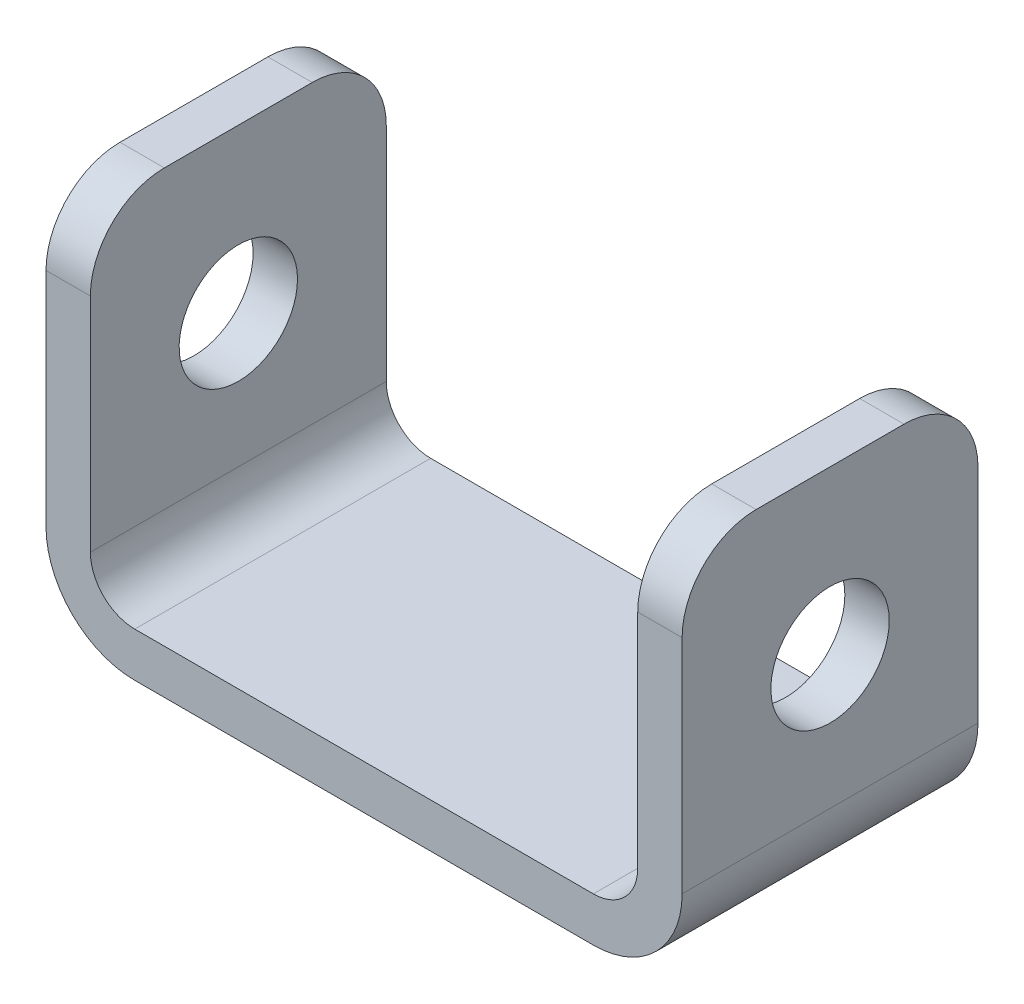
from build123d import *

# Parameters (mm, degrees)
BASE_EXTRUSION_DEPTH    = 10
CONG_1_R                = 5
ESQUISSE2_R             = 4
ENL_V_MAT_EXTRU_1_DEPTH = 52.23475383


with BuildPart() as part:
    # Esquisse1 → Base-Extrusion (new, symmetric)
    with BuildSketch(Plane.XY):
        with BuildLine():
            Line((-15.5, 0), (15.5, 0))
            ThreePointArc((15.5, 0), (19.742640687, 1.757359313), (21.5, 6))
            Line((21.5, 6), (21.5, 26))
            Line((21.5, 26), (18.5, 26))
            Line((18.5, 26), (18.5, 6))
            ThreePointArc((18.5, 6), (17.621320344, 3.878679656), (15.5, 3))
            Line((15.5, 3), (-15.5, 3))
            ThreePointArc((-15.5, 3), (-17.621320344, 3.878679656), (-18.5, 6))
            Line((-18.5, 6), (-18.5, 26))
            Line((-18.5, 26), (-21.5, 26))
            Line((-21.5, 26), (-21.5, 6))
            ThreePointArc((-21.5, 6), (-19.742640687, 1.757359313), (-15.5, 0))
        make_face()
    extrude(amount=BASE_EXTRUSION_DEPTH, both=True)

    # Cong_1
    cong_1_edges = [part.edges().sort_by_distance(p)[0] for p in [
        (-20, 26, -10),
        (-20, 26, 10),
        (20, 26, -10),
        (20, 26, 10),
    ]]
    fillet(cong_1_edges, radius=CONG_1_R)

    # Esquisse2 → Enl_v. mat.-Extru.1 (cut, through all)
    with BuildSketch(Plane(origin=(21.5, 0, 0), x_dir=(0, 0, -1), z_dir=(1, 0, 0))):
        with Locations((0, 15)):
            Circle(ESQUISSE2_R)
    extrude(amount=-ENL_V_MAT_EXTRU_1_DEPTH, mode=Mode.SUBTRACT)


solid = part.part
